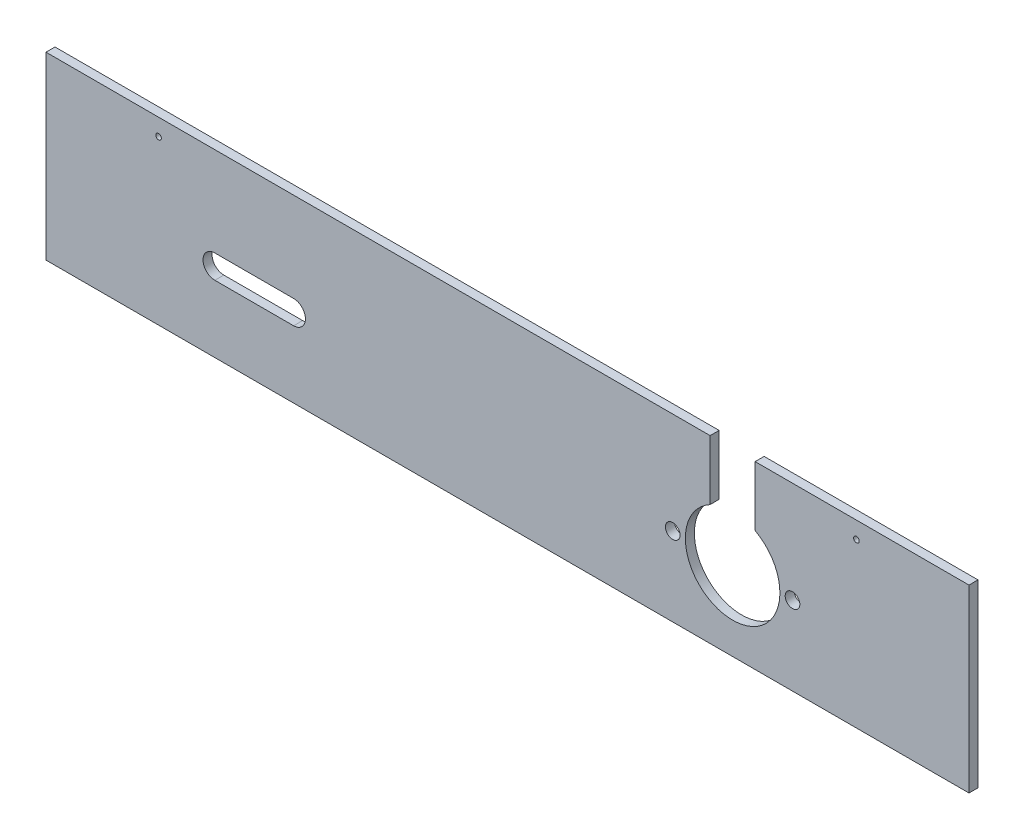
ISO-10303-21;
HEADER;
FILE_DESCRIPTION(('STEP AP214'),'2;1');
FILE_NAME('part.step','',(''),(''),'','','');
FILE_SCHEMA(('AUTOMOTIVE_DESIGN { 1 0 10303 214 1 1 1 1 }'));
ENDSEC;
DATA;
#1=APPLICATION_CONTEXT('core data for automotive mechanical design processes');
#2=APPLICATION_PROTOCOL_DEFINITION('international standard','automotive_design',2000,#1);
#3=PRODUCT_CONTEXT('',#1,'mechanical');
#4=PRODUCT('Part','Part','',(#3));
#5=PRODUCT_RELATED_PRODUCT_CATEGORY('part','',(#4));
#6=PRODUCT_DEFINITION_FORMATION('','',#4);
#7=PRODUCT_DEFINITION_CONTEXT('part definition',#1,'design');
#8=PRODUCT_DEFINITION('design','',#6,#7);
#9=PRODUCT_DEFINITION_SHAPE('','',#8);
#10=(LENGTH_UNIT() NAMED_UNIT(*) SI_UNIT(.MILLI.,.METRE.));
#11=(NAMED_UNIT(*) PLANE_ANGLE_UNIT() SI_UNIT($,.RADIAN.));
#12=(NAMED_UNIT(*) SI_UNIT($,.STERADIAN.) SOLID_ANGLE_UNIT());
#13=UNCERTAINTY_MEASURE_WITH_UNIT(LENGTH_MEASURE(1.E-05),#10,'distance_accuracy_value','');
#14=(GEOMETRIC_REPRESENTATION_CONTEXT(3) GLOBAL_UNCERTAINTY_ASSIGNED_CONTEXT((#13)) GLOBAL_UNIT_ASSIGNED_CONTEXT((#10,
#11,#12)) REPRESENTATION_CONTEXT('',''));
#15=CARTESIAN_POINT('',(0.,0.,0.));
#16=DIRECTION('',(0.,0.,1.));
#17=DIRECTION('',(1.,0.,0.));
#18=AXIS2_PLACEMENT_3D('',#15,#16,#17);
#19=CARTESIAN_POINT('',(0.,0.,8.));
#20=DIRECTION('',(0.,-1.,0.));
#21=DIRECTION('',(0.,0.,-1.));
#22=AXIS2_PLACEMENT_3D('',#19,#20,#21);
#23=PLANE('',#22);
#24=DIRECTION('',(-1.,0.,0.));
#25=VECTOR('',#24,1.);
#26=CARTESIAN_POINT('',(0.,0.,8.));
#27=LINE('',#26,#25);
#28=CARTESIAN_POINT('',(590.,0.,8.));
#29=VERTEX_POINT('',#28);
#30=CARTESIAN_POINT('',(0.,0.,8.));
#31=VERTEX_POINT('',#30);
#32=EDGE_CURVE('E226',#29,#31,#27,.T.);
#33=ORIENTED_EDGE('',*,*,#32,.F.);
#34=DIRECTION('',(0.,0.,1.));
#35=VECTOR('',#34,1.);
#36=CARTESIAN_POINT('',(590.,0.,0.));
#37=LINE('',#36,#35);
#38=CARTESIAN_POINT('',(590.,0.,0.));
#39=VERTEX_POINT('',#38);
#40=EDGE_CURVE('E153',#39,#29,#37,.T.);
#41=ORIENTED_EDGE('',*,*,#40,.F.);
#42=DIRECTION('',(-1.,0.,0.));
#43=VECTOR('',#42,1.);
#44=CARTESIAN_POINT('',(0.,0.,0.));
#45=LINE('',#44,#43);
#46=CARTESIAN_POINT('',(0.,0.,0.));
#47=VERTEX_POINT('',#46);
#48=EDGE_CURVE('E215',#39,#47,#45,.T.);
#49=ORIENTED_EDGE('',*,*,#48,.T.);
#50=DIRECTION('',(0.,0.,-1.));
#51=VECTOR('',#50,1.);
#52=CARTESIAN_POINT('',(0.,0.,8.));
#53=LINE('',#52,#51);
#54=EDGE_CURVE('E228',#31,#47,#53,.T.);
#55=ORIENTED_EDGE('',*,*,#54,.F.);
#56=EDGE_LOOP('',(#33,#41,#49,#55));
#57=FACE_BOUND('',#56,.T.);
#58=ADVANCED_FACE('F31',(#57),#23,.F.);
#59=CARTESIAN_POINT('',(0.,-160.,8.));
#60=DIRECTION('',(0.,0.,1.));
#61=DIRECTION('',(1.,0.,0.));
#62=AXIS2_PLACEMENT_3D('',#59,#60,#61);
#63=PLANE('',#62);
#64=DIRECTION('',(0.,-1.,0.));
#65=VECTOR('',#64,1.);
#66=CARTESIAN_POINT('',(590.,-53.0676293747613,8.));
#67=LINE('',#66,#65);
#68=CARTESIAN_POINT('',(590.,-53.0676293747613,8.));
#69=VERTEX_POINT('',#68);
#70=EDGE_CURVE('E142',#29,#69,#67,.T.);
#71=ORIENTED_EDGE('',*,*,#70,.F.);
#72=ORIENTED_EDGE('',*,*,#32,.T.);
#73=DIRECTION('',(0.,-1.,0.));
#74=VECTOR('',#73,1.);
#75=CARTESIAN_POINT('',(0.,0.,8.));
#76=LINE('',#75,#74);
#77=CARTESIAN_POINT('',(0.,-160.,8.));
#78=VERTEX_POINT('',#77);
#79=EDGE_CURVE('E219',#31,#78,#76,.T.);
#80=ORIENTED_EDGE('',*,*,#79,.T.);
#81=DIRECTION('',(1.,0.,0.));
#82=VECTOR('',#81,1.);
#83=CARTESIAN_POINT('',(0.,-160.,8.));
#84=LINE('',#83,#82);
#85=CARTESIAN_POINT('',(820.,-160.,8.));
#86=VERTEX_POINT('',#85);
#87=EDGE_CURVE('E222',#78,#86,#84,.T.);
#88=ORIENTED_EDGE('',*,*,#87,.T.);
#89=DIRECTION('',(0.,1.,0.));
#90=VECTOR('',#89,1.);
#91=CARTESIAN_POINT('',(820.,0.,8.));
#92=LINE('',#91,#90);
#93=CARTESIAN_POINT('',(820.,0.,8.));
#94=VERTEX_POINT('',#93);
#95=EDGE_CURVE('E224',#86,#94,#92,.T.);
#96=ORIENTED_EDGE('',*,*,#95,.T.);
#97=CARTESIAN_POINT('',(630.,0.,8.));
#98=VERTEX_POINT('',#97);
#99=EDGE_CURVE('E141',#94,#98,#27,.T.);
#100=ORIENTED_EDGE('',*,*,#99,.T.);
#101=DIRECTION('',(0.,1.,0.));
#102=VECTOR('',#101,1.);
#103=CARTESIAN_POINT('',(630.,-53.0676293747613,8.));
#104=LINE('',#103,#102);
#105=CARTESIAN_POINT('',(630.,-53.0676293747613,8.));
#106=VERTEX_POINT('',#105);
#107=EDGE_CURVE('E46',#106,#98,#104,.T.);
#108=ORIENTED_EDGE('',*,*,#107,.F.);
#109=CARTESIAN_POINT('',(610.,-90.,8.));
#110=DIRECTION('',(0.,0.,1.));
#111=DIRECTION('',(1.,0.,0.));
#112=AXIS2_PLACEMENT_3D('',#109,#110,#111);
#113=CIRCLE('',#112,42.);
#114=EDGE_CURVE('E130',#69,#106,#113,.T.);
#115=ORIENTED_EDGE('',*,*,#114,.F.);
#116=EDGE_LOOP('',(#71,#72,#80,#88,#96,#100,#108,#115));
#117=FACE_BOUND('',#116,.T.);
#118=CARTESIAN_POINT('',(556.8,-90.,8.));
#119=DIRECTION('',(0.,0.,1.));
#120=DIRECTION('',(1.,0.,0.));
#121=AXIS2_PLACEMENT_3D('',#118,#119,#120);
#122=CIRCLE('',#121,6.50000000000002);
#123=CARTESIAN_POINT('',(563.3,-90.,8.));
#124=VERTEX_POINT('',#123);
#125=EDGE_CURVE('E152',#124,#124,#122,.T.);
#126=ORIENTED_EDGE('',*,*,#125,.F.);
#127=EDGE_LOOP('',(#126));
#128=FACE_BOUND('',#127,.T.);
#129=CARTESIAN_POINT('',(663.2,-90.,8.));
#130=DIRECTION('',(0.,0.,1.));
#131=DIRECTION('',(1.,0.,0.));
#132=AXIS2_PLACEMENT_3D('',#129,#130,#131);
#133=CIRCLE('',#132,6.4999999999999);
#134=CARTESIAN_POINT('',(669.7,-90.,8.));
#135=VERTEX_POINT('',#134);
#136=EDGE_CURVE('E161',#135,#135,#133,.T.);
#137=ORIENTED_EDGE('',*,*,#136,.F.);
#138=EDGE_LOOP('',(#137));
#139=FACE_BOUND('',#138,.T.);
#140=CARTESIAN_POINT('',(100.,-15.,8.));
#141=DIRECTION('',(0.,0.,1.));
#142=DIRECTION('',(1.,0.,0.));
#143=AXIS2_PLACEMENT_3D('',#140,#141,#142);
#144=CIRCLE('',#143,2.5);
#145=CARTESIAN_POINT('',(102.5,-15.,8.));
#146=VERTEX_POINT('',#145);
#147=EDGE_CURVE('E199',#146,#146,#144,.T.);
#148=ORIENTED_EDGE('',*,*,#147,.F.);
#149=EDGE_LOOP('',(#148));
#150=FACE_BOUND('',#149,.T.);
#151=CARTESIAN_POINT('',(720.,-15.,8.));
#152=DIRECTION('',(0.,0.,1.));
#153=DIRECTION('',(1.,0.,0.));
#154=AXIS2_PLACEMENT_3D('',#151,#152,#153);
#155=CIRCLE('',#154,2.49999999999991);
#156=CARTESIAN_POINT('',(722.5,-15.,8.));
#157=VERTEX_POINT('',#156);
#158=EDGE_CURVE('E205',#157,#157,#155,.T.);
#159=ORIENTED_EDGE('',*,*,#158,.F.);
#160=EDGE_LOOP('',(#159));
#161=FACE_BOUND('',#160,.T.);
#162=DIRECTION('',(1.,0.,0.));
#163=VECTOR('',#162,1.);
#164=CARTESIAN_POINT('',(150.,-100.5,8.));
#165=LINE('',#164,#163);
#166=CARTESIAN_POINT('',(150.,-100.5,8.));
#167=VERTEX_POINT('',#166);
#168=CARTESIAN_POINT('',(220.,-100.5,8.));
#169=VERTEX_POINT('',#168);
#170=EDGE_CURVE('E181',#167,#169,#165,.T.);
#171=ORIENTED_EDGE('',*,*,#170,.F.);
#172=CARTESIAN_POINT('',(150.,-90.,8.));
#173=DIRECTION('',(0.,0.,1.));
#174=DIRECTION('',(1.,0.,0.));
#175=AXIS2_PLACEMENT_3D('',#172,#173,#174);
#176=CIRCLE('',#175,10.5);
#177=CARTESIAN_POINT('',(150.,-79.5,8.));
#178=VERTEX_POINT('',#177);
#179=EDGE_CURVE('E179',#178,#167,#176,.T.);
#180=ORIENTED_EDGE('',*,*,#179,.F.);
#181=DIRECTION('',(-1.,0.,0.));
#182=VECTOR('',#181,1.);
#183=CARTESIAN_POINT('',(150.,-79.5,8.));
#184=LINE('',#183,#182);
#185=CARTESIAN_POINT('',(220.,-79.5,8.));
#186=VERTEX_POINT('',#185);
#187=EDGE_CURVE('E185',#186,#178,#184,.T.);
#188=ORIENTED_EDGE('',*,*,#187,.F.);
#189=CARTESIAN_POINT('',(220.,-90.,8.));
#190=DIRECTION('',(0.,0.,1.));
#191=DIRECTION('',(1.,0.,0.));
#192=AXIS2_PLACEMENT_3D('',#189,#190,#191);
#193=CIRCLE('',#192,10.5);
#194=EDGE_CURVE('E183',#169,#186,#193,.T.);
#195=ORIENTED_EDGE('',*,*,#194,.F.);
#196=EDGE_LOOP('',(#171,#180,#188,#195));
#197=FACE_BOUND('',#196,.T.);
#198=ADVANCED_FACE('F138',(#117,#128,#139,#150,#161,#197),#63,.T.);
#199=CARTESIAN_POINT('',(0.,-160.,0.));
#200=DIRECTION('',(0.,0.,1.));
#201=DIRECTION('',(1.,0.,0.));
#202=AXIS2_PLACEMENT_3D('',#199,#200,#201);
#203=PLANE('',#202);
#204=CARTESIAN_POINT('',(556.8,-90.,0.));
#205=DIRECTION('',(0.,0.,1.));
#206=DIRECTION('',(1.,0.,0.));
#207=AXIS2_PLACEMENT_3D('',#204,#205,#206);
#208=CIRCLE('',#207,6.50000000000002);
#209=CARTESIAN_POINT('',(563.3,-90.,0.));
#210=VERTEX_POINT('',#209);
#211=EDGE_CURVE('E158',#210,#210,#208,.T.);
#212=ORIENTED_EDGE('',*,*,#211,.T.);
#213=EDGE_LOOP('',(#212));
#214=FACE_BOUND('',#213,.T.);
#215=CARTESIAN_POINT('',(663.2,-90.,0.));
#216=DIRECTION('',(0.,0.,1.));
#217=DIRECTION('',(1.,0.,0.));
#218=AXIS2_PLACEMENT_3D('',#215,#216,#217);
#219=CIRCLE('',#218,6.4999999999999);
#220=CARTESIAN_POINT('',(669.7,-90.,0.));
#221=VERTEX_POINT('',#220);
#222=EDGE_CURVE('E164',#221,#221,#219,.T.);
#223=ORIENTED_EDGE('',*,*,#222,.T.);
#224=EDGE_LOOP('',(#223));
#225=FACE_BOUND('',#224,.T.);
#226=CARTESIAN_POINT('',(100.,-15.,0.));
#227=DIRECTION('',(0.,0.,1.));
#228=DIRECTION('',(1.,0.,0.));
#229=AXIS2_PLACEMENT_3D('',#226,#227,#228);
#230=CIRCLE('',#229,2.5);
#231=CARTESIAN_POINT('',(102.5,-15.,0.));
#232=VERTEX_POINT('',#231);
#233=EDGE_CURVE('E196',#232,#232,#230,.T.);
#234=ORIENTED_EDGE('',*,*,#233,.T.);
#235=EDGE_LOOP('',(#234));
#236=FACE_BOUND('',#235,.T.);
#237=ORIENTED_EDGE('',*,*,#48,.F.);
#238=DIRECTION('',(0.,-1.,0.));
#239=VECTOR('',#238,1.);
#240=CARTESIAN_POINT('',(590.,-53.0676293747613,0.));
#241=LINE('',#240,#239);
#242=CARTESIAN_POINT('',(590.,-53.0676293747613,0.));
#243=VERTEX_POINT('',#242);
#244=EDGE_CURVE('E127',#39,#243,#241,.T.);
#245=ORIENTED_EDGE('',*,*,#244,.T.);
#246=CARTESIAN_POINT('',(610.,-90.,0.));
#247=DIRECTION('',(0.,0.,1.));
#248=DIRECTION('',(1.,0.,0.));
#249=AXIS2_PLACEMENT_3D('',#246,#247,#248);
#250=CIRCLE('',#249,42.);
#251=CARTESIAN_POINT('',(630.,-53.0676293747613,0.));
#252=VERTEX_POINT('',#251);
#253=EDGE_CURVE('E144',#243,#252,#250,.T.);
#254=ORIENTED_EDGE('',*,*,#253,.T.);
#255=DIRECTION('',(0.,1.,0.));
#256=VECTOR('',#255,1.);
#257=CARTESIAN_POINT('',(630.,-53.0676293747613,0.));
#258=LINE('',#257,#256);
#259=CARTESIAN_POINT('',(630.,0.,0.));
#260=VERTEX_POINT('',#259);
#261=EDGE_CURVE('E122',#252,#260,#258,.T.);
#262=ORIENTED_EDGE('',*,*,#261,.T.);
#263=CARTESIAN_POINT('',(820.,0.,0.));
#264=VERTEX_POINT('',#263);
#265=EDGE_CURVE('E216',#264,#260,#45,.T.);
#266=ORIENTED_EDGE('',*,*,#265,.F.);
#267=DIRECTION('',(0.,1.,0.));
#268=VECTOR('',#267,1.);
#269=CARTESIAN_POINT('',(820.,0.,0.));
#270=LINE('',#269,#268);
#271=CARTESIAN_POINT('',(820.,-160.,0.));
#272=VERTEX_POINT('',#271);
#273=EDGE_CURVE('E213',#272,#264,#270,.T.);
#274=ORIENTED_EDGE('',*,*,#273,.F.);
#275=DIRECTION('',(1.,0.,0.));
#276=VECTOR('',#275,1.);
#277=CARTESIAN_POINT('',(0.,-160.,0.));
#278=LINE('',#277,#276);
#279=CARTESIAN_POINT('',(0.,-160.,0.));
#280=VERTEX_POINT('',#279);
#281=EDGE_CURVE('E211',#280,#272,#278,.T.);
#282=ORIENTED_EDGE('',*,*,#281,.F.);
#283=DIRECTION('',(0.,-1.,0.));
#284=VECTOR('',#283,1.);
#285=CARTESIAN_POINT('',(0.,0.,0.));
#286=LINE('',#285,#284);
#287=EDGE_CURVE('E208',#47,#280,#286,.T.);
#288=ORIENTED_EDGE('',*,*,#287,.F.);
#289=EDGE_LOOP('',(#237,#245,#254,#262,#266,#274,#282,#288));
#290=FACE_BOUND('',#289,.T.);
#291=CARTESIAN_POINT('',(720.,-15.,0.));
#292=DIRECTION('',(0.,0.,1.));
#293=DIRECTION('',(1.,0.,0.));
#294=AXIS2_PLACEMENT_3D('',#291,#292,#293);
#295=CIRCLE('',#294,2.49999999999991);
#296=CARTESIAN_POINT('',(722.5,-15.,0.));
#297=VERTEX_POINT('',#296);
#298=EDGE_CURVE('E202',#297,#297,#295,.T.);
#299=ORIENTED_EDGE('',*,*,#298,.T.);
#300=EDGE_LOOP('',(#299));
#301=FACE_BOUND('',#300,.T.);
#302=CARTESIAN_POINT('',(150.,-90.,0.));
#303=DIRECTION('',(0.,0.,1.));
#304=DIRECTION('',(1.,0.,0.));
#305=AXIS2_PLACEMENT_3D('',#302,#303,#304);
#306=CIRCLE('',#305,10.5);
#307=CARTESIAN_POINT('',(150.,-79.5,0.));
#308=VERTEX_POINT('',#307);
#309=CARTESIAN_POINT('',(150.,-100.5,0.));
#310=VERTEX_POINT('',#309);
#311=EDGE_CURVE('E167',#308,#310,#306,.T.);
#312=ORIENTED_EDGE('',*,*,#311,.T.);
#313=DIRECTION('',(1.,0.,0.));
#314=VECTOR('',#313,1.);
#315=CARTESIAN_POINT('',(150.,-100.5,0.));
#316=LINE('',#315,#314);
#317=CARTESIAN_POINT('',(220.,-100.5,0.));
#318=VERTEX_POINT('',#317);
#319=EDGE_CURVE('E170',#310,#318,#316,.T.);
#320=ORIENTED_EDGE('',*,*,#319,.T.);
#321=CARTESIAN_POINT('',(220.,-90.,0.));
#322=DIRECTION('',(0.,0.,1.));
#323=DIRECTION('',(1.,0.,0.));
#324=AXIS2_PLACEMENT_3D('',#321,#322,#323);
#325=CIRCLE('',#324,10.5);
#326=CARTESIAN_POINT('',(220.,-79.5,0.));
#327=VERTEX_POINT('',#326);
#328=EDGE_CURVE('E173',#318,#327,#325,.T.);
#329=ORIENTED_EDGE('',*,*,#328,.T.);
#330=DIRECTION('',(-1.,0.,0.));
#331=VECTOR('',#330,1.);
#332=CARTESIAN_POINT('',(150.,-79.5,0.));
#333=LINE('',#332,#331);
#334=EDGE_CURVE('E176',#327,#308,#333,.T.);
#335=ORIENTED_EDGE('',*,*,#334,.T.);
#336=EDGE_LOOP('',(#312,#320,#329,#335));
#337=FACE_BOUND('',#336,.T.);
#338=ADVANCED_FACE('F244',(#214,#225,#236,#290,#301,#337),#203,.F.);
#339=CARTESIAN_POINT('',(0.,0.,8.));
#340=DIRECTION('',(1.,0.,0.));
#341=DIRECTION('',(0.,1.,0.));
#342=AXIS2_PLACEMENT_3D('',#339,#340,#341);
#343=PLANE('',#342);
#344=ORIENTED_EDGE('',*,*,#287,.T.);
#345=DIRECTION('',(0.,0.,-1.));
#346=VECTOR('',#345,1.);
#347=CARTESIAN_POINT('',(0.,-160.,8.));
#348=LINE('',#347,#346);
#349=EDGE_CURVE('E11',#78,#280,#348,.T.);
#350=ORIENTED_EDGE('',*,*,#349,.F.);
#351=ORIENTED_EDGE('',*,*,#79,.F.);
#352=ORIENTED_EDGE('',*,*,#54,.T.);
#353=EDGE_LOOP('',(#344,#350,#351,#352));
#354=FACE_BOUND('',#353,.T.);
#355=ADVANCED_FACE('F33',(#354),#343,.F.);
#356=CARTESIAN_POINT('',(0.,-160.,8.));
#357=DIRECTION('',(0.,1.,0.));
#358=DIRECTION('',(0.,0.,1.));
#359=AXIS2_PLACEMENT_3D('',#356,#357,#358);
#360=PLANE('',#359);
#361=ORIENTED_EDGE('',*,*,#281,.T.);
#362=DIRECTION('',(0.,0.,-1.));
#363=VECTOR('',#362,1.);
#364=CARTESIAN_POINT('',(820.,-160.,8.));
#365=LINE('',#364,#363);
#366=EDGE_CURVE('E39',#86,#272,#365,.T.);
#367=ORIENTED_EDGE('',*,*,#366,.F.);
#368=ORIENTED_EDGE('',*,*,#87,.F.);
#369=ORIENTED_EDGE('',*,*,#349,.T.);
#370=EDGE_LOOP('',(#361,#367,#368,#369));
#371=FACE_BOUND('',#370,.T.);
#372=ADVANCED_FACE('F259',(#371),#360,.F.);
#373=CARTESIAN_POINT('',(820.,0.,8.));
#374=DIRECTION('',(-1.,0.,0.));
#375=DIRECTION('',(0.,0.,1.));
#376=AXIS2_PLACEMENT_3D('',#373,#374,#375);
#377=PLANE('',#376);
#378=ORIENTED_EDGE('',*,*,#273,.T.);
#379=DIRECTION('',(0.,0.,-1.));
#380=VECTOR('',#379,1.);
#381=CARTESIAN_POINT('',(820.,0.,8.));
#382=LINE('',#381,#380);
#383=EDGE_CURVE('E231',#94,#264,#382,.T.);
#384=ORIENTED_EDGE('',*,*,#383,.F.);
#385=ORIENTED_EDGE('',*,*,#95,.F.);
#386=ORIENTED_EDGE('',*,*,#366,.T.);
#387=EDGE_LOOP('',(#378,#384,#385,#386));
#388=FACE_BOUND('',#387,.T.);
#389=ADVANCED_FACE('F238',(#388),#377,.F.);
#390=ORIENTED_EDGE('',*,*,#265,.T.);
#391=DIRECTION('',(0.,0.,1.));
#392=VECTOR('',#391,1.);
#393=CARTESIAN_POINT('',(630.,0.,0.));
#394=LINE('',#393,#392);
#395=EDGE_CURVE('E126',#260,#98,#394,.T.);
#396=ORIENTED_EDGE('',*,*,#395,.T.);
#397=ORIENTED_EDGE('',*,*,#99,.F.);
#398=ORIENTED_EDGE('',*,*,#383,.T.);
#399=EDGE_LOOP('',(#390,#396,#397,#398));
#400=FACE_BOUND('',#399,.T.);
#401=ADVANCED_FACE('F248',(#400),#23,.F.);
#402=CARTESIAN_POINT('',(720.,-15.,8.));
#403=DIRECTION('',(0.,0.,-1.));
#404=DIRECTION('',(-1.,0.,0.));
#405=AXIS2_PLACEMENT_3D('',#402,#403,#404);
#406=CYLINDRICAL_SURFACE('',#405,2.49999999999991);
#407=ORIENTED_EDGE('',*,*,#158,.T.);
#408=EDGE_LOOP('',(#407));
#409=FACE_BOUND('',#408,.T.);
#410=ORIENTED_EDGE('',*,*,#298,.F.);
#411=EDGE_LOOP('',(#410));
#412=FACE_BOUND('',#411,.T.);
#413=ADVANCED_FACE('F250',(#409,#412),#406,.F.);
#414=CARTESIAN_POINT('',(100.,-15.,8.));
#415=DIRECTION('',(0.,0.,-1.));
#416=DIRECTION('',(-1.,0.,0.));
#417=AXIS2_PLACEMENT_3D('',#414,#415,#416);
#418=CYLINDRICAL_SURFACE('',#417,2.5);
#419=ORIENTED_EDGE('',*,*,#147,.T.);
#420=EDGE_LOOP('',(#419));
#421=FACE_BOUND('',#420,.T.);
#422=ORIENTED_EDGE('',*,*,#233,.F.);
#423=EDGE_LOOP('',(#422));
#424=FACE_BOUND('',#423,.T.);
#425=ADVANCED_FACE('F256',(#421,#424),#418,.F.);
#426=CARTESIAN_POINT('',(150.,-90.,8.));
#427=DIRECTION('',(0.,0.,-1.));
#428=DIRECTION('',(-1.,0.,0.));
#429=AXIS2_PLACEMENT_3D('',#426,#427,#428);
#430=CYLINDRICAL_SURFACE('',#429,10.5);
#431=ORIENTED_EDGE('',*,*,#311,.F.);
#432=DIRECTION('',(0.,0.,-1.));
#433=VECTOR('',#432,1.);
#434=CARTESIAN_POINT('',(150.,-79.5,8.));
#435=LINE('',#434,#433);
#436=EDGE_CURVE('E187',#178,#308,#435,.T.);
#437=ORIENTED_EDGE('',*,*,#436,.F.);
#438=ORIENTED_EDGE('',*,*,#179,.T.);
#439=DIRECTION('',(0.,0.,-1.));
#440=VECTOR('',#439,1.);
#441=CARTESIAN_POINT('',(150.,-100.5,8.));
#442=LINE('',#441,#440);
#443=EDGE_CURVE('E193',#167,#310,#442,.T.);
#444=ORIENTED_EDGE('',*,*,#443,.T.);
#445=EDGE_LOOP('',(#431,#437,#438,#444));
#446=FACE_BOUND('',#445,.T.);
#447=ADVANCED_FACE('F290',(#446),#430,.F.);
#448=CARTESIAN_POINT('',(150.,-100.5,8.));
#449=DIRECTION('',(0.,1.,0.));
#450=DIRECTION('',(0.,0.,1.));
#451=AXIS2_PLACEMENT_3D('',#448,#449,#450);
#452=PLANE('',#451);
#453=ORIENTED_EDGE('',*,*,#319,.F.);
#454=ORIENTED_EDGE('',*,*,#443,.F.);
#455=ORIENTED_EDGE('',*,*,#170,.T.);
#456=DIRECTION('',(0.,0.,-1.));
#457=VECTOR('',#456,1.);
#458=CARTESIAN_POINT('',(220.,-100.5,8.));
#459=LINE('',#458,#457);
#460=EDGE_CURVE('E191',#169,#318,#459,.T.);
#461=ORIENTED_EDGE('',*,*,#460,.T.);
#462=EDGE_LOOP('',(#453,#454,#455,#461));
#463=FACE_BOUND('',#462,.T.);
#464=ADVANCED_FACE('F294',(#463),#452,.T.);
#465=CARTESIAN_POINT('',(220.,-90.,8.));
#466=DIRECTION('',(0.,0.,-1.));
#467=DIRECTION('',(-1.,0.,0.));
#468=AXIS2_PLACEMENT_3D('',#465,#466,#467);
#469=CYLINDRICAL_SURFACE('',#468,10.5);
#470=ORIENTED_EDGE('',*,*,#328,.F.);
#471=ORIENTED_EDGE('',*,*,#460,.F.);
#472=ORIENTED_EDGE('',*,*,#194,.T.);
#473=DIRECTION('',(0.,0.,-1.));
#474=VECTOR('',#473,1.);
#475=CARTESIAN_POINT('',(220.,-79.5,8.));
#476=LINE('',#475,#474);
#477=EDGE_CURVE('E54',#186,#327,#476,.T.);
#478=ORIENTED_EDGE('',*,*,#477,.T.);
#479=EDGE_LOOP('',(#470,#471,#472,#478));
#480=FACE_BOUND('',#479,.T.);
#481=ADVANCED_FACE('F298',(#480),#469,.F.);
#482=CARTESIAN_POINT('',(150.,-79.5,8.));
#483=DIRECTION('',(0.,-1.,0.));
#484=DIRECTION('',(0.,0.,-1.));
#485=AXIS2_PLACEMENT_3D('',#482,#483,#484);
#486=PLANE('',#485);
#487=ORIENTED_EDGE('',*,*,#334,.F.);
#488=ORIENTED_EDGE('',*,*,#477,.F.);
#489=ORIENTED_EDGE('',*,*,#187,.T.);
#490=ORIENTED_EDGE('',*,*,#436,.T.);
#491=EDGE_LOOP('',(#487,#488,#489,#490));
#492=FACE_BOUND('',#491,.T.);
#493=ADVANCED_FACE('F302',(#492),#486,.T.);
#494=CARTESIAN_POINT('',(663.2,-90.,0.));
#495=DIRECTION('',(0.,0.,1.));
#496=DIRECTION('',(1.,0.,0.));
#497=AXIS2_PLACEMENT_3D('',#494,#495,#496);
#498=CYLINDRICAL_SURFACE('',#497,6.4999999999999);
#499=ORIENTED_EDGE('',*,*,#222,.F.);
#500=EDGE_LOOP('',(#499));
#501=FACE_BOUND('',#500,.T.);
#502=ORIENTED_EDGE('',*,*,#136,.T.);
#503=EDGE_LOOP('',(#502));
#504=FACE_BOUND('',#503,.T.);
#505=ADVANCED_FACE('F306',(#501,#504),#498,.F.);
#506=CARTESIAN_POINT('',(556.8,-90.,0.));
#507=DIRECTION('',(0.,0.,1.));
#508=DIRECTION('',(1.,0.,0.));
#509=AXIS2_PLACEMENT_3D('',#506,#507,#508);
#510=CYLINDRICAL_SURFACE('',#509,6.50000000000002);
#511=ORIENTED_EDGE('',*,*,#211,.F.);
#512=EDGE_LOOP('',(#511));
#513=FACE_BOUND('',#512,.T.);
#514=ORIENTED_EDGE('',*,*,#125,.T.);
#515=EDGE_LOOP('',(#514));
#516=FACE_BOUND('',#515,.T.);
#517=ADVANCED_FACE('F309',(#513,#516),#510,.F.);
#518=CARTESIAN_POINT('',(610.,-90.,0.));
#519=DIRECTION('',(0.,0.,1.));
#520=DIRECTION('',(1.,0.,0.));
#521=AXIS2_PLACEMENT_3D('',#518,#519,#520);
#522=CYLINDRICAL_SURFACE('',#521,42.);
#523=ORIENTED_EDGE('',*,*,#114,.T.);
#524=DIRECTION('',(0.,0.,1.));
#525=VECTOR('',#524,1.);
#526=CARTESIAN_POINT('',(630.,-53.0676293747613,0.));
#527=LINE('',#526,#525);
#528=EDGE_CURVE('E118',#252,#106,#527,.T.);
#529=ORIENTED_EDGE('',*,*,#528,.F.);
#530=ORIENTED_EDGE('',*,*,#253,.F.);
#531=DIRECTION('',(0.,0.,1.));
#532=VECTOR('',#531,1.);
#533=CARTESIAN_POINT('',(590.,-53.0676293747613,0.));
#534=LINE('',#533,#532);
#535=EDGE_CURVE('E132',#243,#69,#534,.T.);
#536=ORIENTED_EDGE('',*,*,#535,.T.);
#537=EDGE_LOOP('',(#523,#529,#530,#536));
#538=FACE_BOUND('',#537,.T.);
#539=ADVANCED_FACE('F131',(#538),#522,.F.);
#540=CARTESIAN_POINT('',(590.,-53.0676293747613,0.));
#541=DIRECTION('',(-1.,0.,0.));
#542=DIRECTION('',(0.,-1.,0.));
#543=AXIS2_PLACEMENT_3D('',#540,#541,#542);
#544=PLANE('',#543);
#545=ORIENTED_EDGE('',*,*,#70,.T.);
#546=ORIENTED_EDGE('',*,*,#535,.F.);
#547=ORIENTED_EDGE('',*,*,#244,.F.);
#548=ORIENTED_EDGE('',*,*,#40,.T.);
#549=EDGE_LOOP('',(#545,#546,#547,#548));
#550=FACE_BOUND('',#549,.T.);
#551=ADVANCED_FACE('F273',(#550),#544,.F.);
#552=CARTESIAN_POINT('',(630.,-53.0676293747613,0.));
#553=DIRECTION('',(1.,0.,0.));
#554=DIRECTION('',(0.,1.,0.));
#555=AXIS2_PLACEMENT_3D('',#552,#553,#554);
#556=PLANE('',#555);
#557=ORIENTED_EDGE('',*,*,#107,.T.);
#558=ORIENTED_EDGE('',*,*,#395,.F.);
#559=ORIENTED_EDGE('',*,*,#261,.F.);
#560=ORIENTED_EDGE('',*,*,#528,.T.);
#561=EDGE_LOOP('',(#557,#558,#559,#560));
#562=FACE_BOUND('',#561,.T.);
#563=ADVANCED_FACE('F120',(#562),#556,.F.);
#564=CLOSED_SHELL('',(#58,#198,#338,#355,#372,#389,#401,#413,#425,#447,#464,#481,#493,#505,#517,
#539,#551,#563));
#565=MANIFOLD_SOLID_BREP('B2',#564);
#566=ADVANCED_BREP_SHAPE_REPRESENTATION('',(#18,#565),#14);
#567=SHAPE_DEFINITION_REPRESENTATION(#9,#566);
ENDSEC;
END-ISO-10303-21;
